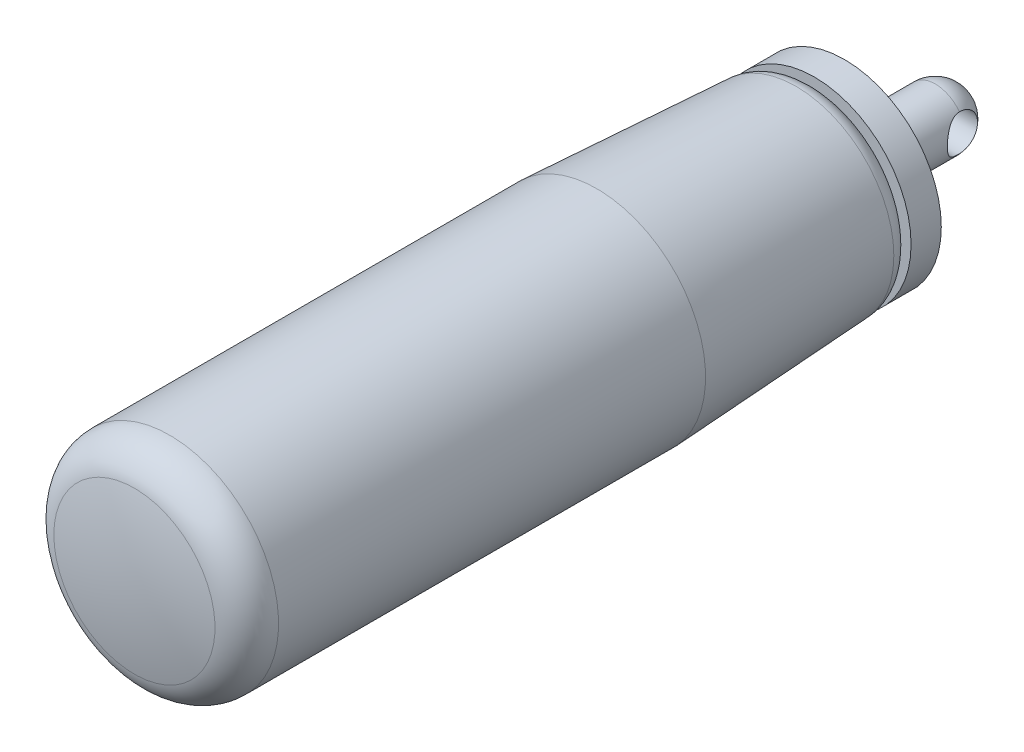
ISO-10303-21;
HEADER;
FILE_DESCRIPTION(('STEP AP214'),'2;1');
FILE_NAME('part.step','',(''),(''),'','','');
FILE_SCHEMA(('AUTOMOTIVE_DESIGN { 1 0 10303 214 1 1 1 1 }'));
ENDSEC;
DATA;
#1=APPLICATION_CONTEXT('core data for automotive mechanical design processes');
#2=APPLICATION_PROTOCOL_DEFINITION('international standard','automotive_design',2000,#1);
#3=PRODUCT_CONTEXT('',#1,'mechanical');
#4=PRODUCT('Part','Part','',(#3));
#5=PRODUCT_RELATED_PRODUCT_CATEGORY('part','',(#4));
#6=PRODUCT_DEFINITION_FORMATION('','',#4);
#7=PRODUCT_DEFINITION_CONTEXT('part definition',#1,'design');
#8=PRODUCT_DEFINITION('design','',#6,#7);
#9=PRODUCT_DEFINITION_SHAPE('','',#8);
#10=(LENGTH_UNIT() NAMED_UNIT(*) SI_UNIT(.MILLI.,.METRE.));
#11=(NAMED_UNIT(*) PLANE_ANGLE_UNIT() SI_UNIT($,.RADIAN.));
#12=(NAMED_UNIT(*) SI_UNIT($,.STERADIAN.) SOLID_ANGLE_UNIT());
#13=UNCERTAINTY_MEASURE_WITH_UNIT(LENGTH_MEASURE(1.E-05),#10,'distance_accuracy_value','');
#14=(GEOMETRIC_REPRESENTATION_CONTEXT(3) GLOBAL_UNCERTAINTY_ASSIGNED_CONTEXT((#13)) GLOBAL_UNIT_ASSIGNED_CONTEXT((#10,
#11,#12)) REPRESENTATION_CONTEXT('',''));
#15=CARTESIAN_POINT('',(0.,0.,0.));
#16=DIRECTION('',(0.,0.,1.));
#17=DIRECTION('',(1.,0.,0.));
#18=AXIS2_PLACEMENT_3D('',#15,#16,#17);
#19=CARTESIAN_POINT('',(0.,0.,0.));
#20=DIRECTION('',(0.,1.,0.));
#21=DIRECTION('',(1.,0.,0.));
#22=AXIS2_PLACEMENT_3D('',#19,#20,#21);
#23=SPHERICAL_SURFACE('',#22,2.5);
#24=CARTESIAN_POINT('',(0.,0.,0.));
#25=DIRECTION('',(0.,0.,-1.));
#26=DIRECTION('',(-1.,0.,0.));
#27=AXIS2_PLACEMENT_3D('',#24,#25,#26);
#28=CIRCLE('',#27,2.49999999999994);
#29=CARTESIAN_POINT('',(1.99999999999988,-1.5,0.));
#30=VERTEX_POINT('',#29);
#31=CARTESIAN_POINT('',(-2.,-1.5,0.));
#32=VERTEX_POINT('',#31);
#33=EDGE_CURVE('E52',#30,#32,#28,.T.);
#34=ORIENTED_EDGE('',*,*,#33,.T.);
#35=CARTESIAN_POINT('',(-2.,0.,0.));
#36=DIRECTION('',(1.,0.,0.));
#37=DIRECTION('',(0.,-1.,0.));
#38=AXIS2_PLACEMENT_3D('',#35,#36,#37);
#39=CIRCLE('',#38,1.5);
#40=CARTESIAN_POINT('',(-2.,1.5,0.));
#41=VERTEX_POINT('',#40);
#42=EDGE_CURVE('E33',#32,#41,#39,.T.);
#43=ORIENTED_EDGE('',*,*,#42,.T.);
#44=CARTESIAN_POINT('',(1.99999999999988,1.5,0.));
#45=VERTEX_POINT('',#44);
#46=EDGE_CURVE('E53',#41,#45,#28,.T.);
#47=ORIENTED_EDGE('',*,*,#46,.T.);
#48=CARTESIAN_POINT('',(2.,0.,0.));
#49=DIRECTION('',(-1.,0.,0.));
#50=DIRECTION('',(0.,1.,0.));
#51=AXIS2_PLACEMENT_3D('',#48,#49,#50);
#52=CIRCLE('',#51,1.5);
#53=EDGE_CURVE('E39',#45,#30,#52,.T.);
#54=ORIENTED_EDGE('',*,*,#53,.T.);
#55=EDGE_LOOP('',(#34,#43,#47,#54));
#56=FACE_BOUND('',#55,.T.);
#57=ADVANCED_FACE('F14',(#56),#23,.T.);
#58=CARTESIAN_POINT('',(0.,0.,-2.5));
#59=DIRECTION('',(0.,0.,-1.));
#60=DIRECTION('',(-1.,0.,0.));
#61=AXIS2_PLACEMENT_3D('',#58,#59,#60);
#62=CYLINDRICAL_SURFACE('',#61,2.49999999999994);
#63=CARTESIAN_POINT('',(0.,0.,7.5));
#64=DIRECTION('',(0.,0.,-1.));
#65=DIRECTION('',(-1.,0.,0.));
#66=AXIS2_PLACEMENT_3D('',#63,#64,#65);
#67=CIRCLE('',#66,2.49999999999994);
#68=CARTESIAN_POINT('',(-2.5,0.,7.5));
#69=VERTEX_POINT('',#68);
#70=EDGE_CURVE('E56',#69,#69,#67,.T.);
#71=ORIENTED_EDGE('',*,*,#70,.T.);
#72=EDGE_LOOP('',(#71));
#73=FACE_BOUND('',#72,.T.);
#74=ORIENTED_EDGE('',*,*,#46,.F.);
#75=CARTESIAN_POINT('',(-2.5,0.,1.5));
#76=CARTESIAN_POINT('',(-2.49999625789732,-0.0767298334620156,1.49999590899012));
#77=CARTESIAN_POINT('',(-2.4964290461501,-0.153582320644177,1.49407132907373));
#78=CARTESIAN_POINT('',(-2.48249903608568,-0.304975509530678,1.47067568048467));
#79=CARTESIAN_POINT('',(-2.47211948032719,-0.379510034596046,1.45317613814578));
#80=CARTESIAN_POINT('',(-2.44561558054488,-0.523751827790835,1.40761363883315));
#81=CARTESIAN_POINT('',(-2.42951973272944,-0.593481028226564,1.37960304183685));
#82=CARTESIAN_POINT('',(-2.39295367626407,-0.727030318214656,1.31413966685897));
#83=CARTESIAN_POINT('',(-2.37248455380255,-0.79085186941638,1.27668923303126));
#84=CARTESIAN_POINT('',(-2.32705360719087,-0.916299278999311,1.19022517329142));
#85=CARTESIAN_POINT('',(-2.30186792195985,-0.977384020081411,1.14054630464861));
#86=CARTESIAN_POINT('',(-2.25030439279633,-1.09088270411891,1.03253279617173));
#87=CARTESIAN_POINT('',(-2.22392505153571,-1.14328534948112,0.974187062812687));
#88=CARTESIAN_POINT('',(-2.1691106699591,-1.24444996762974,0.842076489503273));
#89=CARTESIAN_POINT('',(-2.14082017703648,-1.29197766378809,0.767298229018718));
#90=CARTESIAN_POINT('',(-2.08938301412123,-1.37361437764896,0.609153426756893));
#91=CARTESIAN_POINT('',(-2.06622802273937,-1.40774517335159,0.525801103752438));
#92=CARTESIAN_POINT('',(-2.03354629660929,-1.45440601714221,0.373403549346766));
#93=CARTESIAN_POINT('',(-2.0220788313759,-1.47016197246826,0.305764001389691));
#94=CARTESIAN_POINT('',(-2.00590308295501,-1.49216172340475,0.168196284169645));
#95=CARTESIAN_POINT('',(-2.00118639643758,-1.49841734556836,0.0982710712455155));
#96=CARTESIAN_POINT('',(-1.99920922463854,-1.50105508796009,-0.0420114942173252));
#97=CARTESIAN_POINT('',(-2.00196337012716,-1.49741783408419,-0.112369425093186));
#98=CARTESIAN_POINT('',(-2.0145326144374,-1.48046060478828,-0.251278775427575));
#99=CARTESIAN_POINT('',(-2.02435302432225,-1.46713334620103,-0.319828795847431));
#100=CARTESIAN_POINT('',(-2.04953186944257,-1.43173921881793,-0.452530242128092));
#101=CARTESIAN_POINT('',(-2.06481711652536,-1.40978748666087,-0.516727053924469));
#102=CARTESIAN_POINT('',(-2.09927051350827,-1.35795061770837,-0.640694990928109));
#103=CARTESIAN_POINT('',(-2.11844008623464,-1.32806257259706,-0.70046448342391));
#104=CARTESIAN_POINT('',(-2.16255327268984,-1.25517983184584,-0.824984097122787));
#105=CARTESIAN_POINT('',(-2.18792043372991,-1.21080724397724,-0.888778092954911));
#106=CARTESIAN_POINT('',(-2.2393059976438,-1.11291092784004,-1.008676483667));
#107=CARTESIAN_POINT('',(-2.26532500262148,-1.0593784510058,-1.06477343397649));
#108=CARTESIAN_POINT('',(-2.31935504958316,-0.935811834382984,-1.17561298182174));
#109=CARTESIAN_POINT('',(-2.34713836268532,-0.864517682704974,-1.22907730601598));
#110=CARTESIAN_POINT('',(-2.3977242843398,-0.712276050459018,-1.3231220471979));
#111=CARTESIAN_POINT('',(-2.42052955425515,-0.631333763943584,-1.36370935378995));
#112=CARTESIAN_POINT('',(-2.45730392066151,-0.467197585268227,-1.42793218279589));
#113=CARTESIAN_POINT('',(-2.47173957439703,-0.3844676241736,-1.45247535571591));
#114=CARTESIAN_POINT('',(-2.4921884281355,-0.215047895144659,-1.48701119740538));
#115=CARTESIAN_POINT('',(-2.49821172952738,-0.128363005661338,-1.49702131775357));
#116=CARTESIAN_POINT('',(-2.5009057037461,0.033714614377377,-1.50150784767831));
#117=CARTESIAN_POINT('',(-2.49873521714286,0.109042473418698,-1.49790885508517));
#118=CARTESIAN_POINT('',(-2.48778712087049,0.257829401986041,-1.47957414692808));
#119=CARTESIAN_POINT('',(-2.47900964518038,0.331288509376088,-1.46483865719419));
#120=CARTESIAN_POINT('',(-2.45594792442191,0.472574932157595,-1.42545656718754));
#121=CARTESIAN_POINT('',(-2.44180275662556,0.540495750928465,-1.40105965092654));
#122=CARTESIAN_POINT('',(-2.40913880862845,0.671265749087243,-1.34332262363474));
#123=CARTESIAN_POINT('',(-2.39061916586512,0.73411392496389,-1.30998074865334));
#124=CARTESIAN_POINT('',(-2.34845496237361,0.860006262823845,-1.23144302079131));
#125=CARTESIAN_POINT('',(-2.3244780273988,0.922394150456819,-1.18537617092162));
#126=CARTESIAN_POINT('',(-2.27474265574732,1.03902603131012,-1.0846086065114));
#127=CARTESIAN_POINT('',(-2.24898216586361,1.09326040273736,-1.02989784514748));
#128=CARTESIAN_POINT('',(-2.19445423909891,1.19931996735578,-0.905089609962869));
#129=CARTESIAN_POINT('',(-2.16573241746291,1.24991019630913,-0.833916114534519));
#130=CARTESIAN_POINT('',(-2.1121618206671,1.33845238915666,-0.682783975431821));
#131=CARTESIAN_POINT('',(-2.08730897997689,1.3764176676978,-0.602834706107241));
#132=CARTESIAN_POINT('',(-2.04984909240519,1.43142578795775,-0.453756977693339));
#133=CARTESIAN_POINT('',(-2.03575659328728,1.45121625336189,-0.386019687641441));
#134=CARTESIAN_POINT('',(-2.01409605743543,1.48113663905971,-0.247467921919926));
#135=CARTESIAN_POINT('',(-2.0065189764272,1.4912799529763,-0.176657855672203));
#136=CARTESIAN_POINT('',(-1.99900446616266,1.50134130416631,-0.0336230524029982));
#137=CARTESIAN_POINT('',(-1.99909576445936,1.50122089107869,0.0386059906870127));
#138=CARTESIAN_POINT('',(-2.00697717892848,1.49066472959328,0.181894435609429));
#139=CARTESIAN_POINT('',(-2.01477148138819,1.48022337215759,0.252953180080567));
#140=CARTESIAN_POINT('',(-2.03633185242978,1.45040174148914,0.388488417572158));
#141=CARTESIAN_POINT('',(-2.04979211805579,1.43147636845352,0.453117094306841));
#142=CARTESIAN_POINT('',(-2.0810550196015,1.38563242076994,0.578337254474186));
#143=CARTESIAN_POINT('',(-2.0988592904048,1.35871083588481,0.638927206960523));
#144=CARTESIAN_POINT('',(-2.14012990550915,1.29289245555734,0.764319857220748));
#145=CARTESIAN_POINT('',(-2.16404587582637,1.25279167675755,0.828341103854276));
#146=CARTESIAN_POINT('',(-2.21320127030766,1.16375698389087,0.949380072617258));
#147=CARTESIAN_POINT('',(-2.23844177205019,1.11481579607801,1.00639196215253));
#148=CARTESIAN_POINT('',(-2.29225690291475,1.00009777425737,1.12135094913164));
#149=CARTESIAN_POINT('',(-2.32070308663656,0.93287681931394,1.17793107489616));
#150=CARTESIAN_POINT('',(-2.37365428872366,0.788462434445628,1.27909785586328));
#151=CARTESIAN_POINT('',(-2.39815789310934,0.711265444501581,1.32368021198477));
#152=CARTESIAN_POINT('',(-2.43985578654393,0.551125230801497,1.39778580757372));
#153=CARTESIAN_POINT('',(-2.45725077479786,0.468430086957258,1.42772806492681));
#154=CARTESIAN_POINT('',(-2.48366273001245,0.297973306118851,1.47272469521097));
#155=CARTESIAN_POINT('',(-2.49271125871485,0.210232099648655,1.48783516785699));
#156=CARTESIAN_POINT('',(-2.49802001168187,0.101558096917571,1.49669745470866));
#157=CARTESIAN_POINT('',(-2.49876114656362,0.081276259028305,1.49793441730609));
#158=CARTESIAN_POINT('',(-2.49975164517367,0.0406658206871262,1.49958624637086));
#159=CARTESIAN_POINT('',(-2.50000099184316,0.0203372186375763,1.5000010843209));
#160=CARTESIAN_POINT('',(-2.5,0.,1.5));
#161=B_SPLINE_CURVE_WITH_KNOTS('',3,(#75,#76,#77,#78,#79,#80,#81,#82,#83,#84,#85,#86,#87,#88,
#89,#90,#91,#92,#93,#94,#95,#96,#97,#98,#99,#100,#101,#102,#103,#104,#105,#106,#107,#108,#109,
#110,#111,#112,#113,#114,#115,#116,#117,#118,#119,#120,#121,#122,#123,#124,#125,#126,#127,#128,
#129,#130,#131,#132,#133,#134,#135,#136,#137,#138,#139,#140,#141,#142,#143,#144,#145,#146,#147,
#148,#149,#150,#151,#152,#153,#154,#155,#156,#157,#158,#159,#160),.UNSPECIFIED.,.T.,.F.,(4,2,2,
2,2,2,2,2,2,2,2,2,2,2,2,2,2,2,2,2,2,2,2,2,2,2,2,2,2,2,2,2,2,2,2,2,2,2,2,2,2,2,4),(0.,
0.230102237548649,0.460772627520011,0.690308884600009,0.919788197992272,1.16681590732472,
1.414162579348,1.69183813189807,1.96906040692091,2.17933829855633,2.38935420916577,
2.59978170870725,2.81036753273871,3.01823267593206,3.22617409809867,3.47046995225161,
3.71500044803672,3.9936095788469,4.27206939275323,4.53296790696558,4.79355286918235,
5.01875602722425,5.24395461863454,5.4636778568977,5.68344445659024,5.9260136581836,
6.16886690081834,6.44336762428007,6.71757792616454,6.9325778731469,7.14727888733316,
7.36278425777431,7.57840681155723,7.7836409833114,7.98895251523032,8.22578610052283,
8.46281544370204,8.73854311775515,9.01436946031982,9.28175654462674,9.54812832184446,
9.60911473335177,9.67010326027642),.UNSPECIFIED.);
#162=EDGE_CURVE('E9',#41,#32,#161,.T.);
#163=ORIENTED_EDGE('',*,*,#162,.T.);
#164=ORIENTED_EDGE('',*,*,#33,.F.);
#165=CARTESIAN_POINT('',(1.99999999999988,1.5,0.));
#166=CARTESIAN_POINT('',(1.99999416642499,1.50000404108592,-0.0754789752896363));
#167=CARTESIAN_POINT('',(2.00433633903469,1.49426852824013,-0.150938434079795));
#168=CARTESIAN_POINT('',(2.0209259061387,1.47174965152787,-0.299323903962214));
#169=CARTESIAN_POINT('',(2.03318155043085,1.45495475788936,-0.372247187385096));
#170=CARTESIAN_POINT('',(2.06362339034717,1.41143486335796,-0.513083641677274));
#171=CARTESIAN_POINT('',(2.08176666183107,1.3847815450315,-0.581028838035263));
#172=CARTESIAN_POINT('',(2.12185904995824,1.3225290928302,-0.711437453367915));
#173=CARTESIAN_POINT('',(2.14380930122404,1.28692729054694,-0.773899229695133));
#174=CARTESIAN_POINT('',(2.1922859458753,1.20271292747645,-0.899949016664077));
#175=CARTESIAN_POINT('',(2.2190437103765,1.15304179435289,-0.962740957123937));
#176=CARTESIAN_POINT('',(2.27226229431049,1.04426801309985,-1.07976476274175));
#177=CARTESIAN_POINT('',(2.29872287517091,0.985158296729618,-1.1339901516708));
#178=CARTESIAN_POINT('',(2.35175567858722,0.851442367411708,-1.23813380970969));
#179=CARTESIAN_POINT('',(2.37803133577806,0.775851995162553,-1.28695446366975));
#180=CARTESIAN_POINT('',(2.42443786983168,0.615654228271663,-1.37080972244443));
#181=CARTESIAN_POINT('',(2.44457437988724,0.531055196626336,-1.40585697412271));
#182=CARTESIAN_POINT('',(2.47470987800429,0.363771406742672,-1.45759592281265));
#183=CARTESIAN_POINT('',(2.48549303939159,0.281674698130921,-1.4757203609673));
#184=CARTESIAN_POINT('',(2.49874939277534,0.114970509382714,-1.49794280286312));
#185=CARTESIAN_POINT('',(2.50123038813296,0.0303654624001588,-1.50205397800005));
#186=CARTESIAN_POINT('',(2.49783372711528,-0.127637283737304,-1.49638625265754));
#187=CARTESIAN_POINT('',(2.49295437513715,-0.201123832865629,-1.48826647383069));
#188=CARTESIAN_POINT('',(2.47707997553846,-0.345464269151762,-1.46152020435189));
#189=CARTESIAN_POINT('',(2.46608447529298,-0.416317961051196,-1.44289293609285));
#190=CARTESIAN_POINT('',(2.43884907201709,-0.554056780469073,-1.39583443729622));
#191=CARTESIAN_POINT('',(2.42257910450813,-0.62091649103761,-1.36734693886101));
#192=CARTESIAN_POINT('',(2.38609637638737,-0.748988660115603,-1.30161538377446));
#193=CARTESIAN_POINT('',(2.36588259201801,-0.810199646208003,-1.26436905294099));
#194=CARTESIAN_POINT('',(2.32037925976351,-0.933074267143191,-1.17716090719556));
#195=CARTESIAN_POINT('',(2.29477182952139,-0.993918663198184,-1.12621168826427));
#196=CARTESIAN_POINT('',(2.2425555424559,-1.10671465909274,-1.01559588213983));
#197=CARTESIAN_POINT('',(2.21594536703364,-1.15865401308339,-0.955917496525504));
#198=CARTESIAN_POINT('',(2.16111075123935,-1.25824837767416,-0.821346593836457));
#199=CARTESIAN_POINT('',(2.13305661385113,-1.30470933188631,-0.745492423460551));
#200=CARTESIAN_POINT('',(2.08250879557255,-1.38397217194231,-0.585293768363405));
#201=CARTESIAN_POINT('',(2.06000490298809,-1.41679921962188,-0.50096528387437));
#202=CARTESIAN_POINT('',(2.0289586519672,-1.46077497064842,-0.347606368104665));
#203=CARTESIAN_POINT('',(2.01833888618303,-1.47527903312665,-0.27995936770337));
#204=CARTESIAN_POINT('',(2.00392150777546,-1.49480872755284,-0.142626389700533));
#205=CARTESIAN_POINT('',(2.00011596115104,-1.49984538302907,-0.0729428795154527));
#206=CARTESIAN_POINT('',(1.99988914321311,-1.50014781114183,0.0665516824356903));
#207=CARTESIAN_POINT('',(2.00347810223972,-1.49540004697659,0.136362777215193));
#208=CARTESIAN_POINT('',(2.01751520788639,-1.47640290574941,0.273987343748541));
#209=CARTESIAN_POINT('',(2.027968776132,-1.4621460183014,0.341799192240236));
#210=CARTESIAN_POINT('',(2.05431768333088,-1.42488312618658,0.473714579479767));
#211=CARTESIAN_POINT('',(2.07020622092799,-1.40188805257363,0.53782263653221));
#212=CARTESIAN_POINT('',(2.10571539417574,-1.34796261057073,0.661477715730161));
#213=CARTESIAN_POINT('',(2.12533743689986,-1.31702924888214,0.721023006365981));
#214=CARTESIAN_POINT('',(2.17036819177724,-1.24167439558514,0.845240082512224));
#215=CARTESIAN_POINT('',(2.19618239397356,-1.19582663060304,0.908900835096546));
#216=CARTESIAN_POINT('',(2.24821754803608,-1.09487395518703,1.02828548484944));
#217=CARTESIAN_POINT('',(2.27443886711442,-1.03976018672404,1.0840016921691));
#218=CARTESIAN_POINT('',(2.32835625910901,-0.913274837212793,1.19322400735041));
#219=CARTESIAN_POINT('',(2.35580075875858,-0.840721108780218,1.24550072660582));
#220=CARTESIAN_POINT('',(2.40537639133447,-0.686103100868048,1.33690277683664));
#221=CARTESIAN_POINT('',(2.42751104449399,-0.604045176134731,1.37603682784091));
#222=CARTESIAN_POINT('',(2.46252280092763,-0.438840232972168,1.43686820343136));
#223=CARTESIAN_POINT('',(2.47595588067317,-0.356205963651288,1.4596262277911));
#224=CARTESIAN_POINT('',(2.49440738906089,-0.187383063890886,1.49071460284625));
#225=CARTESIAN_POINT('',(2.49943534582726,-0.101198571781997,1.49906129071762));
#226=CARTESIAN_POINT('',(2.50040600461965,0.0598120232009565,1.50067460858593));
#227=CARTESIAN_POINT('',(2.49747057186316,0.134620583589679,1.49580333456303));
#228=CARTESIAN_POINT('',(2.48512948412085,0.282148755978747,1.47510617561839));
#229=CARTESIAN_POINT('',(2.47572375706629,0.354868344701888,1.45928016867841));
#230=CARTESIAN_POINT('',(2.45149427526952,0.495145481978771,1.41778042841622));
#231=CARTESIAN_POINT('',(2.43675966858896,0.562767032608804,1.39226840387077));
#232=CARTESIAN_POINT('',(2.40303337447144,0.692781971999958,1.33235940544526));
#233=CARTESIAN_POINT('',(2.38404073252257,0.755174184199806,1.29796043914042));
#234=CARTESIAN_POINT('',(2.3409343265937,0.880263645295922,1.21707480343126));
#235=CARTESIAN_POINT('',(2.31648844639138,0.942258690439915,1.16968129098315));
#236=CARTESIAN_POINT('',(2.26601907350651,1.05789751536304,1.0662469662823));
#237=CARTESIAN_POINT('',(2.23999385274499,1.11153190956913,1.01019657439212));
#238=CARTESIAN_POINT('',(2.18528165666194,1.21590975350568,0.882714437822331));
#239=CARTESIAN_POINT('',(2.1566756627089,1.26542406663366,0.810233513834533));
#240=CARTESIAN_POINT('',(2.10376464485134,1.35156817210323,0.656515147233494));
#241=CARTESIAN_POINT('',(2.07945738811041,1.38820466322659,0.575282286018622));
#242=CARTESIAN_POINT('',(2.04080003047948,1.44437116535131,0.41293571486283));
#243=CARTESIAN_POINT('',(2.02577665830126,1.46509526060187,0.33240476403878));
#244=CARTESIAN_POINT('',(2.00539032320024,1.49289268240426,0.167902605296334));
#245=CARTESIAN_POINT('',(2.00000648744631,1.49999550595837,0.0839392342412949));
#246=CARTESIAN_POINT('',(1.99999999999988,1.5,0.));
#247=B_SPLINE_CURVE_WITH_KNOTS('',3,(#165,#166,#167,#168,#169,#170,#171,#172,#173,#174,#175,
#176,#177,#178,#179,#180,#181,#182,#183,#184,#185,#186,#187,#188,#189,#190,#191,#192,#193,#194,
#195,#196,#197,#198,#199,#200,#201,#202,#203,#204,#205,#206,#207,#208,#209,#210,#211,#212,#213,
#214,#215,#216,#217,#218,#219,#220,#221,#222,#223,#224,#225,#226,#227,#228,#229,#230,#231,#232,
#233,#234,#235,#236,#237,#238,#239,#240,#241,#242,#243,#244,#245,#246),.UNSPECIFIED.,.T.,.F.,(4,
2,2,2,2,2,2,2,2,2,2,2,2,2,2,2,2,2,2,2,2,2,2,2,2,2,2,2,2,2,2,2,2,2,2,2,2,2,2,2,4),(0.,
0.226085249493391,0.452406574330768,0.677113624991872,0.901887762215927,1.15414462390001,
1.40659128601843,1.68630157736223,1.9657544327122,2.21853330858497,2.47107452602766,
2.69230130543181,2.91354445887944,3.13607155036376,3.35865648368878,3.60782810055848,
3.85733966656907,4.13576671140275,4.41367760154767,4.62276298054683,4.83160475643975,
5.0407356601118,5.25003193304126,5.45906724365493,5.66818149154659,5.91499438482,
6.16204457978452,6.44121828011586,6.72020638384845,6.97891479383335,7.23732973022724,
7.46129321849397,7.68525920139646,7.90563970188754,8.12606965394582,8.37042963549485,
8.61506198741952,8.89071695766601,9.16622832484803,9.41820120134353,9.66962780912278),.UNSPECIFIED.);
#248=EDGE_CURVE('E27',#30,#45,#247,.T.);
#249=ORIENTED_EDGE('',*,*,#248,.T.);
#250=EDGE_LOOP('',(#74,#163,#164,#249));
#251=FACE_BOUND('',#250,.T.);
#252=ADVANCED_FACE('F55',(#73,#251),#62,.T.);
#253=CARTESIAN_POINT('',(0.,0.,-2.5));
#254=DIRECTION('',(0.,0.,-1.));
#255=DIRECTION('',(-1.,0.,0.));
#256=AXIS2_PLACEMENT_3D('',#253,#254,#255);
#257=CYLINDRICAL_SURFACE('',#256,9.);
#258=CARTESIAN_POINT('',(0.,0.,63.3248931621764));
#259=DIRECTION('',(0.,0.,-1.));
#260=DIRECTION('',(-1.,0.,0.));
#261=AXIS2_PLACEMENT_3D('',#258,#259,#260);
#262=CIRCLE('',#261,9.);
#263=CARTESIAN_POINT('',(-9.00000000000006,0.,63.3248931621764));
#264=VERTEX_POINT('',#263);
#265=EDGE_CURVE('E49',#264,#264,#262,.T.);
#266=ORIENTED_EDGE('',*,*,#265,.T.);
#267=EDGE_LOOP('',(#266));
#268=FACE_BOUND('',#267,.T.);
#269=CARTESIAN_POINT('',(0.,0.,27.9999999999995));
#270=DIRECTION('',(0.,0.,-1.));
#271=DIRECTION('',(-1.,0.,0.));
#272=AXIS2_PLACEMENT_3D('',#269,#270,#271);
#273=CIRCLE('',#272,9.);
#274=CARTESIAN_POINT('',(-9.00000000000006,0.,27.9999999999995));
#275=VERTEX_POINT('',#274);
#276=EDGE_CURVE('E125',#275,#275,#273,.T.);
#277=ORIENTED_EDGE('',*,*,#276,.F.);
#278=EDGE_LOOP('',(#277));
#279=FACE_BOUND('',#278,.T.);
#280=ADVANCED_FACE('F16',(#268,#279),#257,.T.);
#281=CARTESIAN_POINT('',(0.,0.,63.3248931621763));
#282=DIRECTION('',(0.,0.,-1.));
#283=DIRECTION('',(-1.,0.,0.));
#284=AXIS2_PLACEMENT_3D('',#281,#282,#283);
#285=TOROIDAL_SURFACE('',#284,6.,3.00000000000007);
#286=CARTESIAN_POINT('',(0.,0.,66.2498812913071));
#287=DIRECTION('',(0.,0.,-1.));
#288=DIRECTION('',(-1.,0.,0.));
#289=AXIS2_PLACEMENT_3D('',#286,#287,#288);
#290=CIRCLE('',#289,6.66666666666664);
#291=CARTESIAN_POINT('',(-6.6666666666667,0.,66.2498812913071));
#292=VERTEX_POINT('',#291);
#293=EDGE_CURVE('E58',#292,#292,#290,.T.);
#294=ORIENTED_EDGE('',*,*,#293,.T.);
#295=EDGE_LOOP('',(#294));
#296=FACE_BOUND('',#295,.T.);
#297=ORIENTED_EDGE('',*,*,#265,.F.);
#298=EDGE_LOOP('',(#297));
#299=FACE_BOUND('',#298,.T.);
#300=ADVANCED_FACE('F101',(#296,#299),#285,.T.);
#301=CARTESIAN_POINT('',(1.13841629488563E-13,0.,37.));
#302=DIRECTION('',(0.,1.,0.));
#303=DIRECTION('',(1.,0.,0.));
#304=AXIS2_PLACEMENT_3D('',#301,#302,#303);
#305=SPHERICAL_SURFACE('',#304,30.);
#306=CARTESIAN_POINT('',(1.13841629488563E-13,0.,37.));
#307=DIRECTION('',(0.,0.,-1.));
#308=DIRECTION('',(-1.,0.,0.));
#309=AXIS2_PLACEMENT_3D('',#306,#307,#308);
#310=SPHERICAL_SURFACE('',#309,30.);
#311=ORIENTED_EDGE('',*,*,#293,.F.);
#312=EDGE_LOOP('',(#311));
#313=FACE_BOUND('',#312,.T.);
#314=ADVANCED_FACE('F94',(#313),#310,.T.);
#315=CARTESIAN_POINT('',(-8.00000000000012,0.,7.5));
#316=DIRECTION('',(0.,0.,1.));
#317=DIRECTION('',(1.,0.,0.));
#318=AXIS2_PLACEMENT_3D('',#315,#316,#317);
#319=PLANE('',#318);
#320=ORIENTED_EDGE('',*,*,#70,.F.);
#321=EDGE_LOOP('',(#320));
#322=FACE_BOUND('',#321,.T.);
#323=CARTESIAN_POINT('',(0.,0.,7.5));
#324=DIRECTION('',(0.,0.,-1.));
#325=DIRECTION('',(-1.,0.,0.));
#326=AXIS2_PLACEMENT_3D('',#323,#324,#325);
#327=CIRCLE('',#326,8.);
#328=CARTESIAN_POINT('',(-8.00000000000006,0.,7.5));
#329=VERTEX_POINT('',#328);
#330=EDGE_CURVE('E60',#329,#329,#327,.T.);
#331=ORIENTED_EDGE('',*,*,#330,.T.);
#332=EDGE_LOOP('',(#331));
#333=FACE_BOUND('',#332,.T.);
#334=ADVANCED_FACE('F91',(#322,#333),#319,.F.);
#335=CARTESIAN_POINT('',(0.,0.,-2.5));
#336=DIRECTION('',(0.,0.,-1.));
#337=DIRECTION('',(-1.,0.,0.));
#338=AXIS2_PLACEMENT_3D('',#335,#336,#337);
#339=CYLINDRICAL_SURFACE('',#338,8.);
#340=CARTESIAN_POINT('',(0.,0.,10.));
#341=DIRECTION('',(0.,0.,-1.));
#342=DIRECTION('',(-1.,0.,0.));
#343=AXIS2_PLACEMENT_3D('',#340,#341,#342);
#344=CIRCLE('',#343,8.);
#345=CARTESIAN_POINT('',(-8.00000000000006,0.,10.));
#346=VERTEX_POINT('',#345);
#347=EDGE_CURVE('E135',#346,#346,#344,.T.);
#348=ORIENTED_EDGE('',*,*,#347,.T.);
#349=EDGE_LOOP('',(#348));
#350=FACE_BOUND('',#349,.T.);
#351=ORIENTED_EDGE('',*,*,#330,.F.);
#352=EDGE_LOOP('',(#351));
#353=FACE_BOUND('',#352,.T.);
#354=ADVANCED_FACE('F88',(#350,#353),#339,.T.);
#355=CARTESIAN_POINT('',(-8.00000000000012,0.,10.));
#356=DIRECTION('',(0.,0.,1.));
#357=DIRECTION('',(1.,0.,0.));
#358=AXIS2_PLACEMENT_3D('',#355,#356,#357);
#359=PLANE('',#358);
#360=CARTESIAN_POINT('',(0.,0.,10.));
#361=DIRECTION('',(0.,0.,-1.));
#362=DIRECTION('',(-1.,0.,0.));
#363=AXIS2_PLACEMENT_3D('',#360,#361,#362);
#364=CIRCLE('',#363,6.48642165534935);
#365=CARTESIAN_POINT('',(-6.48642165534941,0.,10.));
#366=VERTEX_POINT('',#365);
#367=EDGE_CURVE('E129',#366,#366,#364,.T.);
#368=ORIENTED_EDGE('',*,*,#367,.T.);
#369=EDGE_LOOP('',(#368));
#370=FACE_BOUND('',#369,.T.);
#371=ORIENTED_EDGE('',*,*,#347,.F.);
#372=EDGE_LOOP('',(#371));
#373=FACE_BOUND('',#372,.T.);
#374=ADVANCED_FACE('F84',(#370,#373),#359,.T.);
#375=CARTESIAN_POINT('',(0.,0.,11.6));
#376=DIRECTION('',(0.,0.,-1.));
#377=DIRECTION('',(-1.,0.,0.));
#378=AXIS2_PLACEMENT_3D('',#375,#376,#377);
#379=TOROIDAL_SURFACE('',#378,6.48642165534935,1.60000000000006);
#380=CARTESIAN_POINT('',(0.,0.,11.511247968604));
#381=DIRECTION('',(0.,0.,-1.));
#382=DIRECTION('',(-1.,0.,0.));
#383=AXIS2_PLACEMENT_3D('',#380,#381,#382);
#384=CIRCLE('',#383,8.08395822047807);
#385=CARTESIAN_POINT('',(-8.08395822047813,0.,11.511247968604));
#386=VERTEX_POINT('',#385);
#387=EDGE_CURVE('E126',#386,#386,#384,.T.);
#388=ORIENTED_EDGE('',*,*,#387,.T.);
#389=EDGE_LOOP('',(#388));
#390=FACE_BOUND('',#389,.T.);
#391=ORIENTED_EDGE('',*,*,#367,.F.);
#392=EDGE_LOOP('',(#391));
#393=FACE_BOUND('',#392,.T.);
#394=ADVANCED_FACE('F80',(#390,#393),#379,.T.);
#395=CARTESIAN_POINT('',(0.,0.,11.511247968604));
#396=DIRECTION('',(0.,0.,1.));
#397=DIRECTION('',(1.,0.,0.));
#398=AXIS2_PLACEMENT_3D('',#395,#396,#397);
#399=CONICAL_SURFACE('',#398,8.08395822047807,0.0554985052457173);
#400=ORIENTED_EDGE('',*,*,#276,.T.);
#401=EDGE_LOOP('',(#400));
#402=FACE_BOUND('',#401,.T.);
#403=ORIENTED_EDGE('',*,*,#387,.F.);
#404=EDGE_LOOP('',(#403));
#405=FACE_BOUND('',#404,.T.);
#406=ADVANCED_FACE('F76',(#402,#405),#399,.T.);
#407=CARTESIAN_POINT('',(5.,0.,0.));
#408=DIRECTION('',(-1.,0.,0.));
#409=DIRECTION('',(0.,1.,0.));
#410=AXIS2_PLACEMENT_3D('',#407,#408,#409);
#411=CYLINDRICAL_SURFACE('',#410,1.5);
#412=ORIENTED_EDGE('',*,*,#162,.F.);
#413=ORIENTED_EDGE('',*,*,#42,.F.);
#414=EDGE_LOOP('',(#412,#413));
#415=FACE_BOUND('',#414,.T.);
#416=ORIENTED_EDGE('',*,*,#248,.F.);
#417=ORIENTED_EDGE('',*,*,#53,.F.);
#418=EDGE_LOOP('',(#416,#417));
#419=FACE_BOUND('',#418,.T.);
#420=ADVANCED_FACE('F44',(#415,#419),#411,.F.);
#421=CLOSED_SHELL('',(#57,#252,#280,#300,#314,#334,#354,#374,#394,#406,#420));
#422=MANIFOLD_SOLID_BREP('B1',#421);
#423=ADVANCED_BREP_SHAPE_REPRESENTATION('',(#18,#422),#14);
#424=SHAPE_DEFINITION_REPRESENTATION(#9,#423);
ENDSEC;
END-ISO-10303-21;
